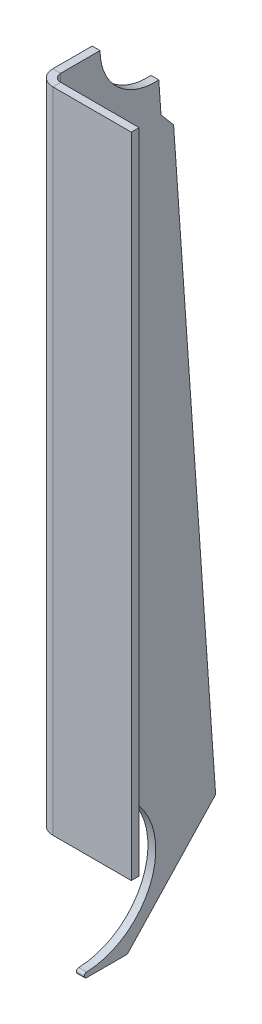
ISO-10303-21;
HEADER;
FILE_DESCRIPTION(('STEP AP214'),'2;1');
FILE_NAME('part.step','',(''),(''),'','','');
FILE_SCHEMA(('AUTOMOTIVE_DESIGN { 1 0 10303 214 1 1 1 1 }'));
ENDSEC;
DATA;
#1=APPLICATION_CONTEXT('core data for automotive mechanical design processes');
#2=APPLICATION_PROTOCOL_DEFINITION('international standard','automotive_design',2000,#1);
#3=PRODUCT_CONTEXT('',#1,'mechanical');
#4=PRODUCT('Part','Part','',(#3));
#5=PRODUCT_RELATED_PRODUCT_CATEGORY('part','',(#4));
#6=PRODUCT_DEFINITION_FORMATION('','',#4);
#7=PRODUCT_DEFINITION_CONTEXT('part definition',#1,'design');
#8=PRODUCT_DEFINITION('design','',#6,#7);
#9=PRODUCT_DEFINITION_SHAPE('','',#8);
#10=(LENGTH_UNIT() NAMED_UNIT(*) SI_UNIT(.MILLI.,.METRE.));
#11=(NAMED_UNIT(*) PLANE_ANGLE_UNIT() SI_UNIT($,.RADIAN.));
#12=(NAMED_UNIT(*) SI_UNIT($,.STERADIAN.) SOLID_ANGLE_UNIT());
#13=UNCERTAINTY_MEASURE_WITH_UNIT(LENGTH_MEASURE(1.E-05),#10,'distance_accuracy_value','');
#14=(GEOMETRIC_REPRESENTATION_CONTEXT(3) GLOBAL_UNCERTAINTY_ASSIGNED_CONTEXT((#13)) GLOBAL_UNIT_ASSIGNED_CONTEXT((#10,
#11,#12)) REPRESENTATION_CONTEXT('',''));
#15=CARTESIAN_POINT('',(0.,0.,0.));
#16=DIRECTION('',(0.,0.,1.));
#17=DIRECTION('',(1.,0.,0.));
#18=AXIS2_PLACEMENT_3D('',#15,#16,#17);
#19=CARTESIAN_POINT('',(6.985,0.,-33.7510796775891));
#20=CARTESIAN_POINT('',(6.77333333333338,0.,-33.7510796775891));
#21=CARTESIAN_POINT('',(6.5616666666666,0.,-33.7510796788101));
#22=CARTESIAN_POINT('',(4.23333333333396,0.,-33.7510796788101));
#23=CARTESIAN_POINT('',(2.11666666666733,0.,-33.7510796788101));
#24=CARTESIAN_POINT('',(-0.211666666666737,0.,-33.7510796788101));
#25=CARTESIAN_POINT('',(-0.423333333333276,0.,-33.7510796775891));
#26=CARTESIAN_POINT('',(-0.635,0.,-33.7510796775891));
#27=CARTESIAN_POINT('',(6.985,-8.23149262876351E-10,-29.8787618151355));
#28=CARTESIAN_POINT('',(6.77333333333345,-8.23149262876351E-10,-29.8787618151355));
#29=CARTESIAN_POINT('',(6.56166666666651,-2.38963441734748E-09,-29.8787618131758));
#30=CARTESIAN_POINT('',(4.23333333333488,-2.38963441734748E-09,-29.8787618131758));
#31=CARTESIAN_POINT('',(2.11666666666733,-2.38963441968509E-09,-29.8787618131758));
#32=CARTESIAN_POINT('',(-0.211666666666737,-2.38963441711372E-09,-29.8787618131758));
#33=CARTESIAN_POINT('',(-0.423333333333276,-8.23149262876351E-10,-29.8787618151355));
#34=CARTESIAN_POINT('',(-0.635,-8.23149262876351E-10,-29.8787618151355));
#35=CARTESIAN_POINT('',(6.985,3.87177827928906,-29.8141199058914));
#36=CARTESIAN_POINT('',(6.77333333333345,3.87177827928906,-29.8141199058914));
#37=CARTESIAN_POINT('',(6.56166666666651,3.87177828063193,-29.8141199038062));
#38=CARTESIAN_POINT('',(4.23333333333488,3.87177828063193,-29.8141199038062));
#39=CARTESIAN_POINT('',(2.11666666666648,3.87177828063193,-29.8141199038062));
#40=CARTESIAN_POINT('',(-0.211666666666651,3.87177828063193,-29.8141199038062));
#41=CARTESIAN_POINT('',(-0.423333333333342,3.87177827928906,-29.8141199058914));
#42=CARTESIAN_POINT('',(-0.635,3.87177827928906,-29.8141199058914));
#43=CARTESIAN_POINT('',(6.985,4.00104408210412,-33.6842795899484));
#44=CARTESIAN_POINT('',(6.77333333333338,4.00104408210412,-33.6842795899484));
#45=CARTESIAN_POINT('',(6.5616666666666,4.00104408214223,-33.6842795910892));
#46=CARTESIAN_POINT('',(4.23333333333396,4.00104408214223,-33.6842795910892));
#47=CARTESIAN_POINT('',(2.11666666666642,4.00104408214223,-33.6842795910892));
#48=CARTESIAN_POINT('',(-0.211666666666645,4.00104408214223,-33.6842795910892));
#49=CARTESIAN_POINT('',(-0.423333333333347,4.00104408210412,-33.6842795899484));
#50=CARTESIAN_POINT('',(-0.635,4.00104408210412,-33.6842795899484));
#51=(BOUNDED_SURFACE() B_SPLINE_SURFACE(3,3,((#19,#20,#21,#22,#23,#24,#25,#26),(#27,#28,#29,#30,
#31,#32,#33,#34),(#35,#36,#37,#38,#39,#40,#41,#42),(#43,#44,#45,#46,#47,#48,#49,#50)),
.UNSPECIFIED.,.F.,.F.,.F.) B_SPLINE_SURFACE_WITH_KNOTS((4,4),(4,2,2,4),(0.,1.),(-0.1,0.,
0.999999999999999,1.1),
.UNSPECIFIED.) GEOMETRIC_REPRESENTATION_ITEM() RATIONAL_B_SPLINE_SURFACE(((1.,1.,1.,1.,1.,1.,1.,
1.),(0.344462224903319,0.344462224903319,0.344462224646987,0.344462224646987,0.344462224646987,
0.344462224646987,0.344462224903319,0.344462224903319),(0.344462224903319,0.344462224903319,
0.344462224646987,0.344462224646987,0.344462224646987,0.344462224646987,0.344462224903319,
0.344462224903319),(1.,1.,1.,1.,1.,1.,1.,1.))) REPRESENTATION_ITEM('') SURFACE());
#52=CARTESIAN_POINT('',(-0.635,0.,-33.7510796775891));
#53=CARTESIAN_POINT('',(-0.423333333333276,0.,-33.7510796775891));
#54=CARTESIAN_POINT('',(-0.211666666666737,0.,-33.7510796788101));
#55=CARTESIAN_POINT('',(2.11666666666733,0.,-33.7510796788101));
#56=CARTESIAN_POINT('',(4.23333333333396,0.,-33.7510796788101));
#57=CARTESIAN_POINT('',(6.5616666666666,0.,-33.7510796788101));
#58=CARTESIAN_POINT('',(6.77333333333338,0.,-33.7510796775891));
#59=CARTESIAN_POINT('',(6.985,0.,-33.7510796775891));
#60=(BOUNDED_CURVE() B_SPLINE_CURVE(3,(#52,#53,#54,#55,#56,#57,#58,#59),.UNSPECIFIED.,.F.,
.F.) B_SPLINE_CURVE_WITH_KNOTS((4,2,2,4),(-0.1,0.,0.999999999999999,1.1),
.UNSPECIFIED.) CURVE() GEOMETRIC_REPRESENTATION_ITEM() RATIONAL_B_SPLINE_CURVE((1.,1.,1.,1.,1.,
1.,1.,1.)) REPRESENTATION_ITEM(''));
#61=CARTESIAN_POINT('',(6.35,0.,-33.7510796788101));
#62=VERTEX_POINT('',#61);
#63=CARTESIAN_POINT('',(0.,0.,-33.7510796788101));
#64=VERTEX_POINT('',#63);
#65=EDGE_CURVE('E200',#62,#64,#60,.F.);
#66=CARTESIAN_POINT('',(6.35,0.,-33.7510796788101));
#67=CARTESIAN_POINT('',(6.35,-2.38963441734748E-09,-29.8787618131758));
#68=CARTESIAN_POINT('',(6.35,3.87177828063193,-29.8141199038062));
#69=CARTESIAN_POINT('',(6.35,4.00104408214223,-33.6842795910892));
#70=(BOUNDED_CURVE() B_SPLINE_CURVE(3,(#66,#67,#68,#69),.UNSPECIFIED.,.F.,
.F.) B_SPLINE_CURVE_WITH_KNOTS((4,4),(0.,1.),
.UNSPECIFIED.) CURVE() GEOMETRIC_REPRESENTATION_ITEM() RATIONAL_B_SPLINE_CURVE((1.,
0.344462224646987,0.344462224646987,1.)) REPRESENTATION_ITEM(''));
#71=CARTESIAN_POINT('',(6.35000000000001,4.00104408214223,-33.6842795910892));
#72=VERTEX_POINT('',#71);
#73=EDGE_CURVE('E48',#72,#62,#70,.F.);
#74=CARTESIAN_POINT('',(6.985,4.00104408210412,-33.6842795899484));
#75=CARTESIAN_POINT('',(6.77333333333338,4.00104408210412,-33.6842795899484));
#76=CARTESIAN_POINT('',(6.5616666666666,4.00104408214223,-33.6842795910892));
#77=CARTESIAN_POINT('',(4.23333333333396,4.00104408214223,-33.6842795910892));
#78=CARTESIAN_POINT('',(2.11666666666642,4.00104408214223,-33.6842795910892));
#79=CARTESIAN_POINT('',(-0.211666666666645,4.00104408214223,-33.6842795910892));
#80=CARTESIAN_POINT('',(-0.423333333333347,4.00104408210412,-33.6842795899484));
#81=CARTESIAN_POINT('',(-0.635,4.00104408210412,-33.6842795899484));
#82=(BOUNDED_CURVE() B_SPLINE_CURVE(3,(#74,#75,#76,#77,#78,#79,#80,#81),.UNSPECIFIED.,.F.,
.F.) B_SPLINE_CURVE_WITH_KNOTS((4,2,2,4),(-0.1,0.,0.999999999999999,1.1),
.UNSPECIFIED.) CURVE() GEOMETRIC_REPRESENTATION_ITEM() RATIONAL_B_SPLINE_CURVE((1.,1.,1.,1.,1.,
1.,1.,1.)) REPRESENTATION_ITEM(''));
#83=CARTESIAN_POINT('',(0.,4.00104408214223,-33.6842795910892));
#84=VERTEX_POINT('',#83);
#85=EDGE_CURVE('E254',#84,#72,#82,.F.);
#86=CARTESIAN_POINT('',(0.,4.00104408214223,-33.6842795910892));
#87=CARTESIAN_POINT('',(0.,3.87177828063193,-29.8141199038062));
#88=CARTESIAN_POINT('',(0.,-2.38963441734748E-09,-29.8787618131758));
#89=CARTESIAN_POINT('',(0.,0.,-33.7510796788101));
#90=(BOUNDED_CURVE() B_SPLINE_CURVE(3,(#86,#87,#88,#89),.UNSPECIFIED.,.F.,
.F.) B_SPLINE_CURVE_WITH_KNOTS((4,4),(0.,1.),
.UNSPECIFIED.) CURVE() GEOMETRIC_REPRESENTATION_ITEM() RATIONAL_B_SPLINE_CURVE((1.,
0.344462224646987,0.344462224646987,1.)) REPRESENTATION_ITEM(''));
#91=EDGE_CURVE('E11',#64,#84,#90,.F.);
#92=ORIENTED_EDGE('',*,*,#65,.F.);
#93=ORIENTED_EDGE('',*,*,#73,.F.);
#94=ORIENTED_EDGE('',*,*,#85,.F.);
#95=ORIENTED_EDGE('',*,*,#91,.F.);
#96=EDGE_LOOP('',(#92,#93,#94,#95));
#97=FACE_BOUND('',#96,.T.);
#98=ADVANCED_FACE('F36',(#97),#51,.T.);
#99=CARTESIAN_POINT('',(6.34999999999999,644.525,-138.1125));
#100=DIRECTION('',(1.,0.,0.));
#101=DIRECTION('',(0.,0.,-1.));
#102=AXIS2_PLACEMENT_3D('',#99,#100,#101);
#103=PLANE('',#102);
#104=CARTESIAN_POINT('',(6.35000000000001,61.9125,-31.7499999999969));
#105=DIRECTION('',(1.,0.,0.));
#106=DIRECTION('',(0.,0.,-1.));
#107=AXIS2_PLACEMENT_3D('',#104,#105,#106);
#108=CIRCLE('',#107,57.94375);
#109=CARTESIAN_POINT('',(6.34999999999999,119.85625,-31.7499999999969));
#110=VERTEX_POINT('',#109);
#111=EDGE_CURVE('E485',#72,#110,#108,.T.);
#112=ORIENTED_EDGE('',*,*,#111,.F.);
#113=ORIENTED_EDGE('',*,*,#73,.T.);
#114=DIRECTION('',(0.,0.,1.));
#115=VECTOR('',#114,1.);
#116=CARTESIAN_POINT('',(6.34999999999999,0.,-138.1125));
#117=LINE('',#116,#115);
#118=CARTESIAN_POINT('',(6.35,0.,-66.675));
#119=VERTEX_POINT('',#118);
#120=EDGE_CURVE('E189',#119,#62,#117,.T.);
#121=ORIENTED_EDGE('',*,*,#120,.F.);
#122=DIRECTION('',(0.,-0.729537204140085,0.68394112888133));
#123=VECTOR('',#122,1.);
#124=CARTESIAN_POINT('',(6.34999999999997,378.676507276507,-421.684225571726));
#125=LINE('',#124,#123);
#126=CARTESIAN_POINT('',(6.35000000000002,76.2,-138.1125));
#127=VERTEX_POINT('',#126);
#128=EDGE_CURVE('E558',#127,#119,#125,.T.);
#129=ORIENTED_EDGE('',*,*,#128,.F.);
#130=DIRECTION('',(0.,-0.997564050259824,-0.0697564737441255));
#131=VECTOR('',#130,1.);
#132=CARTESIAN_POINT('',(6.34999999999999,641.759550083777,-98.5647236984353));
#133=LINE('',#132,#131);
#134=CARTESIAN_POINT('',(6.35000000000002,562.684195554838,-104.094211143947));
#135=VERTEX_POINT('',#134);
#136=EDGE_CURVE('E560',#135,#127,#133,.T.);
#137=ORIENTED_EDGE('',*,*,#136,.F.);
#138=DIRECTION('',(0.,-0.766044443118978,-0.642787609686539));
#139=VECTOR('',#138,1.);
#140=CARTESIAN_POINT('',(6.34999999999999,593.959613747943,-77.851019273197));
#141=LINE('',#140,#139);
#142=CARTESIAN_POINT('',(6.35000000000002,574.845151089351,-93.889957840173));
#143=VERTEX_POINT('',#142);
#144=EDGE_CURVE('E576',#143,#135,#141,.T.);
#145=ORIENTED_EDGE('',*,*,#144,.F.);
#146=DIRECTION('',(0.,-0.997564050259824,-0.0697564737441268));
#147=VECTOR('',#146,1.);
#148=CARTESIAN_POINT('',(6.34999999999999,641.108646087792,-89.2563628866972));
#149=LINE('',#148,#147);
#150=CARTESIAN_POINT('',(6.34999999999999,600.183277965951,-92.1181434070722));
#151=VERTEX_POINT('',#150);
#152=EDGE_CURVE('E165',#151,#143,#149,.T.);
#153=ORIENTED_EDGE('',*,*,#152,.F.);
#154=CARTESIAN_POINT('',(6.34999999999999,644.525,-89.0174681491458));
#155=DIRECTION('',(-1.,0.,0.));
#156=DIRECTION('',(0.,0.,1.));
#157=AXIS2_PLACEMENT_3D('',#154,#155,#156);
#158=CIRCLE('',#157,44.45);
#159=CARTESIAN_POINT('',(6.35,644.525,-44.5674681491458));
#160=VERTEX_POINT('',#159);
#161=EDGE_CURVE('E148',#151,#160,#158,.T.);
#162=ORIENTED_EDGE('',*,*,#161,.T.);
#163=DIRECTION('',(0.,0.,1.));
#164=VECTOR('',#163,1.);
#165=CARTESIAN_POINT('',(6.34999999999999,644.525,-138.1125));
#166=LINE('',#165,#164);
#167=CARTESIAN_POINT('',(6.35,644.525,-12.7));
#168=VERTEX_POINT('',#167);
#169=EDGE_CURVE('E162',#160,#168,#166,.T.);
#170=ORIENTED_EDGE('',*,*,#169,.T.);
#171=DIRECTION('',(0.,-1.,0.));
#172=VECTOR('',#171,1.);
#173=CARTESIAN_POINT('',(6.35,644.525,-12.7));
#174=LINE('',#173,#172);
#175=CARTESIAN_POINT('',(6.35,119.85625,-12.7));
#176=VERTEX_POINT('',#175);
#177=EDGE_CURVE('E503',#168,#176,#174,.T.);
#178=ORIENTED_EDGE('',*,*,#177,.T.);
#179=DIRECTION('',(0.,0.,1.));
#180=VECTOR('',#179,1.);
#181=CARTESIAN_POINT('',(6.34999999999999,119.85625,-138.1125));
#182=LINE('',#181,#180);
#183=EDGE_CURVE('E531',#110,#176,#182,.T.);
#184=ORIENTED_EDGE('',*,*,#183,.F.);
#185=EDGE_LOOP('',(#112,#113,#121,#129,#137,#145,#153,#162,#170,#178,#184));
#186=FACE_BOUND('',#185,.T.);
#187=ADVANCED_FACE('F160',(#186),#103,.T.);
#188=CARTESIAN_POINT('',(0.,644.525,-138.1125));
#189=DIRECTION('',(1.,0.,0.));
#190=DIRECTION('',(0.,0.,-1.));
#191=AXIS2_PLACEMENT_3D('',#188,#189,#190);
#192=PLANE('',#191);
#193=DIRECTION('',(0.,0.,1.));
#194=VECTOR('',#193,1.);
#195=CARTESIAN_POINT('',(0.,0.,-138.1125));
#196=LINE('',#195,#194);
#197=CARTESIAN_POINT('',(0.,0.,-66.675));
#198=VERTEX_POINT('',#197);
#199=EDGE_CURVE('E193',#198,#64,#196,.T.);
#200=ORIENTED_EDGE('',*,*,#199,.T.);
#201=ORIENTED_EDGE('',*,*,#91,.T.);
#202=CARTESIAN_POINT('',(0.,61.9125,-31.7499999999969));
#203=DIRECTION('',(1.,0.,0.));
#204=DIRECTION('',(0.,0.,-1.));
#205=AXIS2_PLACEMENT_3D('',#202,#203,#204);
#206=CIRCLE('',#205,57.94375);
#207=CARTESIAN_POINT('',(0.,119.85625,-31.749999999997));
#208=VERTEX_POINT('',#207);
#209=EDGE_CURVE('E205',#84,#208,#206,.T.);
#210=ORIENTED_EDGE('',*,*,#209,.T.);
#211=DIRECTION('',(0.,0.,-1.));
#212=VECTOR('',#211,1.);
#213=CARTESIAN_POINT('',(0.,119.85625,-31.7499999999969));
#214=LINE('',#213,#212);
#215=CARTESIAN_POINT('',(0.,119.85625,-12.7));
#216=VERTEX_POINT('',#215);
#217=EDGE_CURVE('E524',#216,#208,#214,.T.);
#218=ORIENTED_EDGE('',*,*,#217,.F.);
#219=DIRECTION('',(0.,-1.,0.));
#220=VECTOR('',#219,1.);
#221=CARTESIAN_POINT('',(0.,644.525,-12.7));
#222=LINE('',#221,#220);
#223=CARTESIAN_POINT('',(0.,644.525,-12.7));
#224=VERTEX_POINT('',#223);
#225=EDGE_CURVE('E505',#224,#216,#222,.T.);
#226=ORIENTED_EDGE('',*,*,#225,.F.);
#227=DIRECTION('',(0.,0.,1.));
#228=VECTOR('',#227,1.);
#229=CARTESIAN_POINT('',(0.,644.525,-138.1125));
#230=LINE('',#229,#228);
#231=CARTESIAN_POINT('',(0.,644.525,-44.5674681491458));
#232=VERTEX_POINT('',#231);
#233=EDGE_CURVE('E171',#232,#224,#230,.T.);
#234=ORIENTED_EDGE('',*,*,#233,.F.);
#235=CARTESIAN_POINT('',(0.,644.525,-89.0174681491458));
#236=DIRECTION('',(-1.,0.,0.));
#237=DIRECTION('',(0.,0.,1.));
#238=AXIS2_PLACEMENT_3D('',#235,#236,#237);
#239=CIRCLE('',#238,44.45);
#240=CARTESIAN_POINT('',(0.,600.183277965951,-92.1181434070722));
#241=VERTEX_POINT('',#240);
#242=EDGE_CURVE('E151',#241,#232,#239,.T.);
#243=ORIENTED_EDGE('',*,*,#242,.F.);
#244=DIRECTION('',(0.,-0.997564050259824,-0.0697564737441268));
#245=VECTOR('',#244,1.);
#246=CARTESIAN_POINT('',(0.,641.108646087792,-89.2563628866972));
#247=LINE('',#246,#245);
#248=CARTESIAN_POINT('',(0.,574.845151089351,-93.889957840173));
#249=VERTEX_POINT('',#248);
#250=EDGE_CURVE('E551',#241,#249,#247,.T.);
#251=ORIENTED_EDGE('',*,*,#250,.T.);
#252=DIRECTION('',(0.,-0.766044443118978,-0.642787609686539));
#253=VECTOR('',#252,1.);
#254=CARTESIAN_POINT('',(0.,593.959613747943,-77.851019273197));
#255=LINE('',#254,#253);
#256=CARTESIAN_POINT('',(0.,562.684195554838,-104.094211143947));
#257=VERTEX_POINT('',#256);
#258=EDGE_CURVE('E539',#249,#257,#255,.T.);
#259=ORIENTED_EDGE('',*,*,#258,.T.);
#260=DIRECTION('',(0.,-0.997564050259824,-0.0697564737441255));
#261=VECTOR('',#260,1.);
#262=CARTESIAN_POINT('',(0.,641.759550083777,-98.5647236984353));
#263=LINE('',#262,#261);
#264=CARTESIAN_POINT('',(0.,76.2,-138.1125));
#265=VERTEX_POINT('',#264);
#266=EDGE_CURVE('E548',#257,#265,#263,.T.);
#267=ORIENTED_EDGE('',*,*,#266,.T.);
#268=DIRECTION('',(0.,-0.729537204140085,0.68394112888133));
#269=VECTOR('',#268,1.);
#270=CARTESIAN_POINT('',(0.,378.676507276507,-421.684225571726));
#271=LINE('',#270,#269);
#272=EDGE_CURVE('E554',#265,#198,#271,.T.);
#273=ORIENTED_EDGE('',*,*,#272,.T.);
#274=EDGE_LOOP('',(#200,#201,#210,#218,#226,#234,#243,#251,#259,#267,#273));
#275=FACE_BOUND('',#274,.T.);
#276=ADVANCED_FACE('F228',(#275),#192,.F.);
#277=CARTESIAN_POINT('',(12.7,644.525,-6.35));
#278=DIRECTION('',(0.,1.,0.));
#279=DIRECTION('',(0.,0.,1.));
#280=AXIS2_PLACEMENT_3D('',#277,#278,#279);
#281=PLANE('',#280);
#282=ORIENTED_EDGE('',*,*,#169,.F.);
#283=DIRECTION('',(-1.,0.,0.));
#284=VECTOR('',#283,1.);
#285=CARTESIAN_POINT('',(0.,644.525,-44.5674681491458));
#286=LINE('',#285,#284);
#287=EDGE_CURVE('E145',#232,#160,#286,.F.);
#288=ORIENTED_EDGE('',*,*,#287,.F.);
#289=ORIENTED_EDGE('',*,*,#233,.T.);
#290=DIRECTION('',(1.,0.,0.));
#291=VECTOR('',#290,1.);
#292=CARTESIAN_POINT('',(0.,644.525,-12.7));
#293=LINE('',#292,#291);
#294=EDGE_CURVE('E169',#224,#168,#293,.T.);
#295=ORIENTED_EDGE('',*,*,#294,.T.);
#296=EDGE_LOOP('',(#282,#288,#289,#295));
#297=FACE_BOUND('',#296,.T.);
#298=ADVANCED_FACE('F167',(#297),#281,.T.);
#299=CARTESIAN_POINT('',(6.34999999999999,641.108646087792,-89.2563628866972));
#300=DIRECTION('',(0.,-0.0697564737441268,0.997564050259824));
#301=DIRECTION('',(0.,-0.997564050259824,-0.0697564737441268));
#302=AXIS2_PLACEMENT_3D('',#299,#300,#301);
#303=PLANE('',#302);
#304=ORIENTED_EDGE('',*,*,#250,.F.);
#305=DIRECTION('',(-1.,0.,0.));
#306=VECTOR('',#305,1.);
#307=CARTESIAN_POINT('',(0.,600.183277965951,-92.1181434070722));
#308=LINE('',#307,#306);
#309=EDGE_CURVE('E155',#241,#151,#308,.F.);
#310=ORIENTED_EDGE('',*,*,#309,.T.);
#311=ORIENTED_EDGE('',*,*,#152,.T.);
#312=DIRECTION('',(1.,0.,0.));
#313=VECTOR('',#312,1.);
#314=CARTESIAN_POINT('',(6.35000000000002,574.845151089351,-93.889957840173));
#315=LINE('',#314,#313);
#316=EDGE_CURVE('E536',#143,#249,#315,.F.);
#317=ORIENTED_EDGE('',*,*,#316,.T.);
#318=EDGE_LOOP('',(#304,#310,#311,#317));
#319=FACE_BOUND('',#318,.T.);
#320=ADVANCED_FACE('F219',(#319),#303,.F.);
#321=CARTESIAN_POINT('',(12.7,0.,-12.7));
#322=DIRECTION('',(0.,1.,0.));
#323=DIRECTION('',(1.,0.,0.));
#324=AXIS2_PLACEMENT_3D('',#321,#322,#323);
#325=PLANE('',#324);
#326=ORIENTED_EDGE('',*,*,#120,.T.);
#327=ORIENTED_EDGE('',*,*,#65,.T.);
#328=ORIENTED_EDGE('',*,*,#199,.F.);
#329=DIRECTION('',(1.,0.,0.));
#330=VECTOR('',#329,1.);
#331=CARTESIAN_POINT('',(6.35,0.,-66.675));
#332=LINE('',#331,#330);
#333=EDGE_CURVE('E194',#119,#198,#332,.F.);
#334=ORIENTED_EDGE('',*,*,#333,.F.);
#335=EDGE_LOOP('',(#326,#327,#328,#334));
#336=FACE_BOUND('',#335,.T.);
#337=ADVANCED_FACE('F208',(#336),#325,.F.);
#338=CARTESIAN_POINT('',(0.,644.525,0.));
#339=DIRECTION('',(0.,0.,-1.));
#340=DIRECTION('',(-1.,0.,0.));
#341=AXIS2_PLACEMENT_3D('',#338,#339,#340);
#342=PLANE('',#341);
#343=DIRECTION('',(0.,-1.,0.));
#344=VECTOR('',#343,1.);
#345=CARTESIAN_POINT('',(12.7,644.525,0.));
#346=LINE('',#345,#344);
#347=CARTESIAN_POINT('',(12.7,644.525,0.));
#348=VERTEX_POINT('',#347);
#349=CARTESIAN_POINT('',(12.7,119.85625,0.));
#350=VERTEX_POINT('',#349);
#351=EDGE_CURVE('E183',#348,#350,#346,.T.);
#352=ORIENTED_EDGE('',*,*,#351,.T.);
#353=DIRECTION('',(1.,0.,0.));
#354=VECTOR('',#353,1.);
#355=CARTESIAN_POINT('',(0.,119.85625,0.));
#356=LINE('',#355,#354);
#357=CARTESIAN_POINT('',(76.2,119.85625,0.));
#358=VERTEX_POINT('',#357);
#359=EDGE_CURVE('E512',#350,#358,#356,.T.);
#360=ORIENTED_EDGE('',*,*,#359,.T.);
#361=DIRECTION('',(0.,-1.,0.));
#362=VECTOR('',#361,1.);
#363=CARTESIAN_POINT('',(76.2,644.525,0.));
#364=LINE('',#363,#362);
#365=CARTESIAN_POINT('',(76.2,644.525,0.));
#366=VERTEX_POINT('',#365);
#367=EDGE_CURVE('E494',#366,#358,#364,.T.);
#368=ORIENTED_EDGE('',*,*,#367,.F.);
#369=DIRECTION('',(1.,0.,0.));
#370=VECTOR('',#369,1.);
#371=CARTESIAN_POINT('',(0.,644.525,0.));
#372=LINE('',#371,#370);
#373=EDGE_CURVE('E513',#348,#366,#372,.T.);
#374=ORIENTED_EDGE('',*,*,#373,.F.);
#375=EDGE_LOOP('',(#352,#360,#368,#374));
#376=FACE_BOUND('',#375,.T.);
#377=ADVANCED_FACE('F218',(#376),#342,.F.);
#378=CARTESIAN_POINT('',(76.2,644.525,-6.35));
#379=DIRECTION('',(1.,0.,0.));
#380=DIRECTION('',(0.,0.,-1.));
#381=AXIS2_PLACEMENT_3D('',#378,#379,#380);
#382=PLANE('',#381);
#383=DIRECTION('',(0.,0.,-1.));
#384=VECTOR('',#383,1.);
#385=CARTESIAN_POINT('',(76.2,119.85625,-31.7499999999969));
#386=LINE('',#385,#384);
#387=CARTESIAN_POINT('',(76.2,119.85625,-6.35));
#388=VERTEX_POINT('',#387);
#389=EDGE_CURVE('E519',#358,#388,#386,.T.);
#390=ORIENTED_EDGE('',*,*,#389,.T.);
#391=DIRECTION('',(0.,-1.,0.));
#392=VECTOR('',#391,1.);
#393=CARTESIAN_POINT('',(76.2,644.525,-6.35));
#394=LINE('',#393,#392);
#395=CARTESIAN_POINT('',(76.2,644.525,-6.35));
#396=VERTEX_POINT('',#395);
#397=EDGE_CURVE('E497',#396,#388,#394,.T.);
#398=ORIENTED_EDGE('',*,*,#397,.F.);
#399=DIRECTION('',(0.,0.,1.));
#400=VECTOR('',#399,1.);
#401=CARTESIAN_POINT('',(76.2,644.525,-6.35));
#402=LINE('',#401,#400);
#403=EDGE_CURVE('E564',#396,#366,#402,.T.);
#404=ORIENTED_EDGE('',*,*,#403,.T.);
#405=ORIENTED_EDGE('',*,*,#367,.T.);
#406=EDGE_LOOP('',(#390,#398,#404,#405));
#407=FACE_BOUND('',#406,.T.);
#408=ADVANCED_FACE('F307',(#407),#382,.T.);
#409=CARTESIAN_POINT('',(0.,644.525,-6.35));
#410=DIRECTION('',(0.,0.,-1.));
#411=DIRECTION('',(-1.,0.,0.));
#412=AXIS2_PLACEMENT_3D('',#409,#410,#411);
#413=PLANE('',#412);
#414=DIRECTION('',(1.,0.,0.));
#415=VECTOR('',#414,1.);
#416=CARTESIAN_POINT('',(0.,119.85625,-6.35));
#417=LINE('',#416,#415);
#418=CARTESIAN_POINT('',(12.7,119.85625,-6.34999999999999));
#419=VERTEX_POINT('',#418);
#420=EDGE_CURVE('E529',#419,#388,#417,.T.);
#421=ORIENTED_EDGE('',*,*,#420,.F.);
#422=DIRECTION('',(0.,-1.,0.));
#423=VECTOR('',#422,1.);
#424=CARTESIAN_POINT('',(12.7,644.525,-6.35));
#425=LINE('',#424,#423);
#426=CARTESIAN_POINT('',(12.7,644.525,-6.35));
#427=VERTEX_POINT('',#426);
#428=EDGE_CURVE('E500',#427,#419,#425,.T.);
#429=ORIENTED_EDGE('',*,*,#428,.F.);
#430=DIRECTION('',(1.,0.,0.));
#431=VECTOR('',#430,1.);
#432=CARTESIAN_POINT('',(0.,644.525,-6.35));
#433=LINE('',#432,#431);
#434=EDGE_CURVE('E177',#427,#396,#433,.T.);
#435=ORIENTED_EDGE('',*,*,#434,.T.);
#436=ORIENTED_EDGE('',*,*,#397,.T.);
#437=EDGE_LOOP('',(#421,#429,#435,#436));
#438=FACE_BOUND('',#437,.T.);
#439=ADVANCED_FACE('F316',(#438),#413,.T.);
#440=CARTESIAN_POINT('',(12.7,644.525,-12.7));
#441=DIRECTION('',(0.,-1.,0.));
#442=DIRECTION('',(0.,0.,-1.));
#443=AXIS2_PLACEMENT_3D('',#440,#441,#442);
#444=CYLINDRICAL_SURFACE('',#443,6.35);
#445=CARTESIAN_POINT('',(12.7,119.85625,-12.7));
#446=DIRECTION('',(0.,1.,0.));
#447=DIRECTION('',(0.,0.,1.));
#448=AXIS2_PLACEMENT_3D('',#445,#446,#447);
#449=CIRCLE('',#448,6.35);
#450=EDGE_CURVE('E521',#176,#419,#449,.T.);
#451=ORIENTED_EDGE('',*,*,#450,.F.);
#452=ORIENTED_EDGE('',*,*,#177,.F.);
#453=CARTESIAN_POINT('',(12.7,644.525,-12.7));
#454=DIRECTION('',(0.,1.,0.));
#455=DIRECTION('',(1.,0.,0.));
#456=AXIS2_PLACEMENT_3D('',#453,#454,#455);
#457=CIRCLE('',#456,6.35);
#458=EDGE_CURVE('E172',#168,#427,#457,.T.);
#459=ORIENTED_EDGE('',*,*,#458,.T.);
#460=ORIENTED_EDGE('',*,*,#428,.T.);
#461=EDGE_LOOP('',(#451,#452,#459,#460));
#462=FACE_BOUND('',#461,.T.);
#463=ADVANCED_FACE('F226',(#462),#444,.F.);
#464=CARTESIAN_POINT('',(12.7,644.525,-12.7));
#465=DIRECTION('',(0.,-1.,0.));
#466=DIRECTION('',(0.,0.,-1.));
#467=AXIS2_PLACEMENT_3D('',#464,#465,#466);
#468=CYLINDRICAL_SURFACE('',#467,12.7);
#469=ORIENTED_EDGE('',*,*,#225,.T.);
#470=CARTESIAN_POINT('',(12.7,119.85625,-12.7));
#471=DIRECTION('',(0.,1.,0.));
#472=DIRECTION('',(0.,0.,1.));
#473=AXIS2_PLACEMENT_3D('',#470,#471,#472);
#474=CIRCLE('',#473,12.7);
#475=EDGE_CURVE('E516',#216,#350,#474,.T.);
#476=ORIENTED_EDGE('',*,*,#475,.T.);
#477=ORIENTED_EDGE('',*,*,#351,.F.);
#478=CARTESIAN_POINT('',(12.7,644.525,-12.7));
#479=DIRECTION('',(0.,-1.,0.));
#480=DIRECTION('',(0.,0.,-1.));
#481=AXIS2_PLACEMENT_3D('',#478,#479,#480);
#482=CIRCLE('',#481,12.7);
#483=EDGE_CURVE('E174',#224,#348,#482,.F.);
#484=ORIENTED_EDGE('',*,*,#483,.F.);
#485=EDGE_LOOP('',(#469,#476,#477,#484));
#486=FACE_BOUND('',#485,.T.);
#487=ADVANCED_FACE('F222',(#486),#468,.T.);
#488=CARTESIAN_POINT('',(0.,644.525,-12.7));
#489=DIRECTION('',(0.,1.,0.));
#490=DIRECTION('',(0.,0.,1.));
#491=AXIS2_PLACEMENT_3D('',#488,#489,#490);
#492=PLANE('',#491);
#493=ORIENTED_EDGE('',*,*,#294,.F.);
#494=ORIENTED_EDGE('',*,*,#483,.T.);
#495=DIRECTION('',(0.,0.,1.));
#496=VECTOR('',#495,1.);
#497=CARTESIAN_POINT('',(12.7,644.525,-6.35));
#498=LINE('',#497,#496);
#499=EDGE_CURVE('E490',#427,#348,#498,.T.);
#500=ORIENTED_EDGE('',*,*,#499,.F.);
#501=ORIENTED_EDGE('',*,*,#458,.F.);
#502=EDGE_LOOP('',(#493,#494,#500,#501));
#503=FACE_BOUND('',#502,.T.);
#504=ADVANCED_FACE('F225',(#503),#492,.T.);
#505=CARTESIAN_POINT('',(12.7,644.525,-12.7));
#506=DIRECTION('',(0.,1.,0.));
#507=DIRECTION('',(1.,0.,0.));
#508=AXIS2_PLACEMENT_3D('',#505,#506,#507);
#509=PLANE('',#508);
#510=ORIENTED_EDGE('',*,*,#373,.T.);
#511=ORIENTED_EDGE('',*,*,#403,.F.);
#512=ORIENTED_EDGE('',*,*,#434,.F.);
#513=ORIENTED_EDGE('',*,*,#499,.T.);
#514=EDGE_LOOP('',(#510,#511,#512,#513));
#515=FACE_BOUND('',#514,.T.);
#516=ADVANCED_FACE('F220',(#515),#509,.T.);
#517=CARTESIAN_POINT('',(6.34999999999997,378.676507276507,-421.684225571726));
#518=DIRECTION('',(0.,0.68394112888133,0.729537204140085));
#519=DIRECTION('',(0.,-0.729537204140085,0.68394112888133));
#520=AXIS2_PLACEMENT_3D('',#517,#518,#519);
#521=PLANE('',#520);
#522=ORIENTED_EDGE('',*,*,#128,.T.);
#523=ORIENTED_EDGE('',*,*,#333,.T.);
#524=ORIENTED_EDGE('',*,*,#272,.F.);
#525=DIRECTION('',(1.,0.,0.));
#526=VECTOR('',#525,1.);
#527=CARTESIAN_POINT('',(6.35000000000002,76.2,-138.1125));
#528=LINE('',#527,#526);
#529=EDGE_CURVE('E557',#127,#265,#528,.F.);
#530=ORIENTED_EDGE('',*,*,#529,.F.);
#531=EDGE_LOOP('',(#522,#523,#524,#530));
#532=FACE_BOUND('',#531,.T.);
#533=ADVANCED_FACE('F347',(#532),#521,.F.);
#534=CARTESIAN_POINT('',(6.34999999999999,593.959613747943,-77.851019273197));
#535=DIRECTION('',(0.,-0.642787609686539,0.766044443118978));
#536=DIRECTION('',(0.,-0.766044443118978,-0.642787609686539));
#537=AXIS2_PLACEMENT_3D('',#534,#535,#536);
#538=PLANE('',#537);
#539=ORIENTED_EDGE('',*,*,#316,.F.);
#540=ORIENTED_EDGE('',*,*,#144,.T.);
#541=DIRECTION('',(1.,0.,0.));
#542=VECTOR('',#541,1.);
#543=CARTESIAN_POINT('',(6.35000000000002,562.684195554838,-104.094211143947));
#544=LINE('',#543,#542);
#545=EDGE_CURVE('E543',#135,#257,#544,.F.);
#546=ORIENTED_EDGE('',*,*,#545,.T.);
#547=ORIENTED_EDGE('',*,*,#258,.F.);
#548=EDGE_LOOP('',(#539,#540,#546,#547));
#549=FACE_BOUND('',#548,.T.);
#550=ADVANCED_FACE('F354',(#549),#538,.F.);
#551=CARTESIAN_POINT('',(6.34999999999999,641.759550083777,-98.5647236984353));
#552=DIRECTION('',(0.,-0.0697564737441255,0.997564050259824));
#553=DIRECTION('',(0.,-0.997564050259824,-0.0697564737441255));
#554=AXIS2_PLACEMENT_3D('',#551,#552,#553);
#555=PLANE('',#554);
#556=ORIENTED_EDGE('',*,*,#545,.F.);
#557=ORIENTED_EDGE('',*,*,#136,.T.);
#558=ORIENTED_EDGE('',*,*,#529,.T.);
#559=ORIENTED_EDGE('',*,*,#266,.F.);
#560=EDGE_LOOP('',(#556,#557,#558,#559));
#561=FACE_BOUND('',#560,.T.);
#562=ADVANCED_FACE('F361',(#561),#555,.F.);
#563=CARTESIAN_POINT('',(6.35000000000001,61.9125,-31.7499999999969));
#564=DIRECTION('',(1.,0.,0.));
#565=DIRECTION('',(0.,0.,-1.));
#566=AXIS2_PLACEMENT_3D('',#563,#564,#565);
#567=CYLINDRICAL_SURFACE('',#566,57.94375);
#568=ORIENTED_EDGE('',*,*,#209,.F.);
#569=ORIENTED_EDGE('',*,*,#85,.T.);
#570=ORIENTED_EDGE('',*,*,#111,.T.);
#571=DIRECTION('',(1.,0.,0.));
#572=VECTOR('',#571,1.);
#573=CARTESIAN_POINT('',(6.35000000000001,119.85625,-31.749999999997));
#574=LINE('',#573,#572);
#575=EDGE_CURVE('E486',#208,#110,#574,.T.);
#576=ORIENTED_EDGE('',*,*,#575,.F.);
#577=EDGE_LOOP('',(#568,#569,#570,#576));
#578=FACE_BOUND('',#577,.T.);
#579=ADVANCED_FACE('F368',(#578),#567,.F.);
#580=CARTESIAN_POINT('',(76.2,119.85625,-31.7499999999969));
#581=DIRECTION('',(0.,1.,0.));
#582=DIRECTION('',(0.,0.,1.));
#583=AXIS2_PLACEMENT_3D('',#580,#581,#582);
#584=PLANE('',#583);
#585=ORIENTED_EDGE('',*,*,#183,.T.);
#586=ORIENTED_EDGE('',*,*,#450,.T.);
#587=ORIENTED_EDGE('',*,*,#420,.T.);
#588=ORIENTED_EDGE('',*,*,#389,.F.);
#589=ORIENTED_EDGE('',*,*,#359,.F.);
#590=ORIENTED_EDGE('',*,*,#475,.F.);
#591=ORIENTED_EDGE('',*,*,#217,.T.);
#592=ORIENTED_EDGE('',*,*,#575,.T.);
#593=EDGE_LOOP('',(#585,#586,#587,#588,#589,#590,#591,#592));
#594=FACE_BOUND('',#593,.T.);
#595=ADVANCED_FACE('F375',(#594),#584,.F.);
#596=CARTESIAN_POINT('',(0.,644.525,-89.0174681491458));
#597=DIRECTION('',(-1.,0.,0.));
#598=DIRECTION('',(0.,0.,1.));
#599=AXIS2_PLACEMENT_3D('',#596,#597,#598);
#600=CYLINDRICAL_SURFACE('',#599,44.45);
#601=ORIENTED_EDGE('',*,*,#309,.F.);
#602=ORIENTED_EDGE('',*,*,#242,.T.);
#603=ORIENTED_EDGE('',*,*,#287,.T.);
#604=ORIENTED_EDGE('',*,*,#161,.F.);
#605=EDGE_LOOP('',(#601,#602,#603,#604));
#606=FACE_BOUND('',#605,.T.);
#607=ADVANCED_FACE('F147',(#606),#600,.F.);
#608=CLOSED_SHELL('',(#98,#187,#276,#298,#320,#337,#377,#408,#439,#463,#487,#504,#516,#533,#550,
#562,#579,#595,#607));
#609=MANIFOLD_SOLID_BREP('B2',#608);
#610=ADVANCED_BREP_SHAPE_REPRESENTATION('',(#18,#609),#14);
#611=SHAPE_DEFINITION_REPRESENTATION(#9,#610);
ENDSEC;
END-ISO-10303-21;
